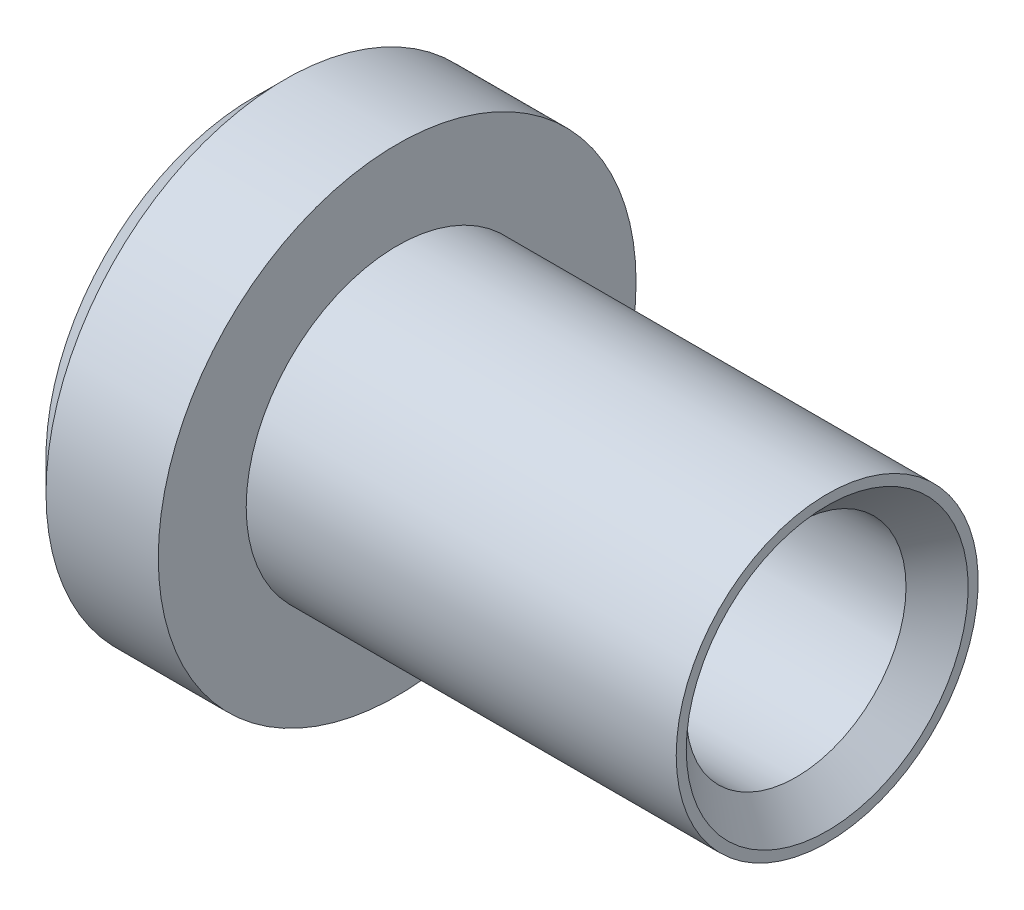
ISO-10303-21;
HEADER;
FILE_DESCRIPTION(('STEP AP214'),'2;1');
FILE_NAME('part.step','',(''),(''),'','','');
FILE_SCHEMA(('AUTOMOTIVE_DESIGN { 1 0 10303 214 1 1 1 1 }'));
ENDSEC;
DATA;
#1=APPLICATION_CONTEXT('core data for automotive mechanical design processes');
#2=APPLICATION_PROTOCOL_DEFINITION('international standard','automotive_design',2000,#1);
#3=PRODUCT_CONTEXT('',#1,'mechanical');
#4=PRODUCT('Part','Part','',(#3));
#5=PRODUCT_RELATED_PRODUCT_CATEGORY('part','',(#4));
#6=PRODUCT_DEFINITION_FORMATION('','',#4);
#7=PRODUCT_DEFINITION_CONTEXT('part definition',#1,'design');
#8=PRODUCT_DEFINITION('design','',#6,#7);
#9=PRODUCT_DEFINITION_SHAPE('','',#8);
#10=(LENGTH_UNIT() NAMED_UNIT(*) SI_UNIT(.MILLI.,.METRE.));
#11=(NAMED_UNIT(*) PLANE_ANGLE_UNIT() SI_UNIT($,.RADIAN.));
#12=(NAMED_UNIT(*) SI_UNIT($,.STERADIAN.) SOLID_ANGLE_UNIT());
#13=UNCERTAINTY_MEASURE_WITH_UNIT(LENGTH_MEASURE(1.E-05),#10,'distance_accuracy_value','');
#14=(GEOMETRIC_REPRESENTATION_CONTEXT(3) GLOBAL_UNCERTAINTY_ASSIGNED_CONTEXT((#13)) GLOBAL_UNIT_ASSIGNED_CONTEXT((#10,
#11,#12)) REPRESENTATION_CONTEXT('',''));
#15=CARTESIAN_POINT('',(0.,0.,0.));
#16=DIRECTION('',(0.,0.,1.));
#17=DIRECTION('',(1.,0.,0.));
#18=AXIS2_PLACEMENT_3D('',#15,#16,#17);
#19=CARTESIAN_POINT('',(0.,0.,0.));
#20=DIRECTION('',(1.,0.,0.));
#21=DIRECTION('',(0.,0.,-1.));
#22=AXIS2_PLACEMENT_3D('',#19,#20,#21);
#23=PLANE('',#22);
#24=CARTESIAN_POINT('',(0.,0.,0.));
#25=DIRECTION('',(1.,0.,0.));
#26=DIRECTION('',(0.,0.,-1.));
#27=AXIS2_PLACEMENT_3D('',#24,#25,#26);
#28=CIRCLE('',#27,5.5245);
#29=CARTESIAN_POINT('',(0.,0.,-5.5245));
#30=VERTEX_POINT('',#29);
#31=EDGE_CURVE('E44',#30,#30,#28,.F.);
#32=ORIENTED_EDGE('',*,*,#31,.T.);
#33=EDGE_LOOP('',(#32));
#34=FACE_BOUND('',#33,.T.);
#35=ADVANCED_FACE('F37',(#34),#23,.F.);
#36=CARTESIAN_POINT('',(0.,0.,0.));
#37=DIRECTION('',(-1.,0.,0.));
#38=DIRECTION('',(0.,0.,1.));
#39=AXIS2_PLACEMENT_3D('',#36,#37,#38);
#40=CYLINDRICAL_SURFACE('',#39,6.35);
#41=CARTESIAN_POINT('',(0.825500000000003,0.,0.));
#42=DIRECTION('',(1.,0.,0.));
#43=DIRECTION('',(0.,0.,-1.));
#44=AXIS2_PLACEMENT_3D('',#41,#42,#43);
#45=CIRCLE('',#44,6.35);
#46=CARTESIAN_POINT('',(0.825500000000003,0.,-6.35));
#47=VERTEX_POINT('',#46);
#48=EDGE_CURVE('E11',#47,#47,#45,.T.);
#49=ORIENTED_EDGE('',*,*,#48,.T.);
#50=EDGE_LOOP('',(#49));
#51=FACE_BOUND('',#50,.T.);
#52=CARTESIAN_POINT('',(3.81,0.,0.));
#53=DIRECTION('',(-1.,0.,0.));
#54=DIRECTION('',(0.,0.,1.));
#55=AXIS2_PLACEMENT_3D('',#52,#53,#54);
#56=CIRCLE('',#55,6.35);
#57=CARTESIAN_POINT('',(3.81,0.,6.35));
#58=VERTEX_POINT('',#57);
#59=EDGE_CURVE('E97',#58,#58,#56,.T.);
#60=ORIENTED_EDGE('',*,*,#59,.T.);
#61=EDGE_LOOP('',(#60));
#62=FACE_BOUND('',#61,.T.);
#63=ADVANCED_FACE('F63',(#51,#62),#40,.T.);
#64=CARTESIAN_POINT('',(3.81,6.35,0.));
#65=DIRECTION('',(-1.,0.,0.));
#66=DIRECTION('',(0.,0.,1.));
#67=AXIS2_PLACEMENT_3D('',#64,#65,#66);
#68=PLANE('',#67);
#69=ORIENTED_EDGE('',*,*,#59,.F.);
#70=EDGE_LOOP('',(#69));
#71=FACE_BOUND('',#70,.T.);
#72=CARTESIAN_POINT('',(3.81,0.,0.));
#73=DIRECTION('',(-1.,0.,0.));
#74=DIRECTION('',(0.,0.,1.));
#75=AXIS2_PLACEMENT_3D('',#72,#73,#74);
#76=CIRCLE('',#75,4.0132);
#77=CARTESIAN_POINT('',(3.81,0.,4.0132));
#78=VERTEX_POINT('',#77);
#79=EDGE_CURVE('E93',#78,#78,#76,.T.);
#80=ORIENTED_EDGE('',*,*,#79,.T.);
#81=EDGE_LOOP('',(#80));
#82=FACE_BOUND('',#81,.T.);
#83=ADVANCED_FACE('F69',(#71,#82),#68,.F.);
#84=CARTESIAN_POINT('',(0.,0.,0.));
#85=DIRECTION('',(-1.,0.,0.));
#86=DIRECTION('',(0.,0.,1.));
#87=AXIS2_PLACEMENT_3D('',#84,#85,#86);
#88=CYLINDRICAL_SURFACE('',#87,4.0132);
#89=ORIENTED_EDGE('',*,*,#79,.F.);
#90=EDGE_LOOP('',(#89));
#91=FACE_BOUND('',#90,.T.);
#92=CARTESIAN_POINT('',(15.24,0.,0.));
#93=DIRECTION('',(-1.,0.,0.));
#94=DIRECTION('',(0.,0.,1.));
#95=AXIS2_PLACEMENT_3D('',#92,#93,#94);
#96=CIRCLE('',#95,4.0132);
#97=CARTESIAN_POINT('',(15.24,0.,4.0132));
#98=VERTEX_POINT('',#97);
#99=EDGE_CURVE('E91',#98,#98,#96,.T.);
#100=ORIENTED_EDGE('',*,*,#99,.T.);
#101=EDGE_LOOP('',(#100));
#102=FACE_BOUND('',#101,.T.);
#103=ADVANCED_FACE('F76',(#91,#102),#88,.T.);
#104=CARTESIAN_POINT('',(15.24,4.0132,0.));
#105=DIRECTION('',(-1.,0.,0.));
#106=DIRECTION('',(0.,0.,1.));
#107=AXIS2_PLACEMENT_3D('',#104,#105,#106);
#108=PLANE('',#107);
#109=CARTESIAN_POINT('',(15.24,0.,0.));
#110=DIRECTION('',(-1.,0.,0.));
#111=DIRECTION('',(0.,0.,1.));
#112=AXIS2_PLACEMENT_3D('',#109,#110,#111);
#113=CIRCLE('',#112,3.74649999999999);
#114=CARTESIAN_POINT('',(15.24,0.,3.74649999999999));
#115=VERTEX_POINT('',#114);
#116=EDGE_CURVE('E88',#115,#115,#113,.T.);
#117=ORIENTED_EDGE('',*,*,#116,.T.);
#118=EDGE_LOOP('',(#117));
#119=FACE_BOUND('',#118,.T.);
#120=ORIENTED_EDGE('',*,*,#99,.F.);
#121=EDGE_LOOP('',(#120));
#122=FACE_BOUND('',#121,.T.);
#123=ADVANCED_FACE('F58',(#119,#122),#108,.F.);
#124=CARTESIAN_POINT('',(0.,0.,0.));
#125=DIRECTION('',(-1.,0.,0.));
#126=DIRECTION('',(0.,0.,1.));
#127=AXIS2_PLACEMENT_3D('',#124,#125,#126);
#128=CYLINDRICAL_SURFACE('',#127,2.921);
#129=CARTESIAN_POINT('',(14.4145,0.,0.));
#130=DIRECTION('',(-1.,0.,0.));
#131=DIRECTION('',(0.,0.,1.));
#132=AXIS2_PLACEMENT_3D('',#129,#130,#131);
#133=CIRCLE('',#132,2.921);
#134=CARTESIAN_POINT('',(14.4145,0.,2.921));
#135=VERTEX_POINT('',#134);
#136=EDGE_CURVE('E105',#135,#135,#133,.F.);
#137=ORIENTED_EDGE('',*,*,#136,.T.);
#138=EDGE_LOOP('',(#137));
#139=FACE_BOUND('',#138,.T.);
#140=CARTESIAN_POINT('',(4.445,0.,0.));
#141=DIRECTION('',(-1.,0.,0.));
#142=DIRECTION('',(0.,0.,1.));
#143=AXIS2_PLACEMENT_3D('',#140,#141,#142);
#144=CIRCLE('',#143,2.921);
#145=CARTESIAN_POINT('',(4.445,0.,2.921));
#146=VERTEX_POINT('',#145);
#147=EDGE_CURVE('E94',#146,#146,#144,.T.);
#148=ORIENTED_EDGE('',*,*,#147,.T.);
#149=EDGE_LOOP('',(#148));
#150=FACE_BOUND('',#149,.T.);
#151=ADVANCED_FACE('F50',(#139,#150),#128,.F.);
#152=CARTESIAN_POINT('',(2.68988613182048,0.,0.));
#153=DIRECTION('',(1.,0.,0.));
#154=DIRECTION('',(0.,0.,-1.));
#155=AXIS2_PLACEMENT_3D('',#152,#153,#154);
#156=CONICAL_SURFACE('',#155,0.,1.02974425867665);
#157=ORIENTED_EDGE('',*,*,#147,.F.);
#158=EDGE_LOOP('',(#157));
#159=FACE_BOUND('',#158,.T.);
#160=CARTESIAN_POINT('',(2.68988613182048,0.,0.));
#161=VERTEX_POINT('',#160);
#162=VERTEX_LOOP('',#161);
#163=FACE_BOUND('',#162,.T.);
#164=ADVANCED_FACE('F47',(#159,#163),#156,.F.);
#165=CARTESIAN_POINT('',(15.24,0.,0.));
#166=DIRECTION('',(1.,0.,0.));
#167=DIRECTION('',(0.,0.,-1.));
#168=AXIS2_PLACEMENT_3D('',#165,#166,#167);
#169=CONICAL_SURFACE('',#168,3.74649999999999,0.785398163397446);
#170=ORIENTED_EDGE('',*,*,#136,.F.);
#171=EDGE_LOOP('',(#170));
#172=FACE_BOUND('',#171,.T.);
#173=ORIENTED_EDGE('',*,*,#116,.F.);
#174=EDGE_LOOP('',(#173));
#175=FACE_BOUND('',#174,.T.);
#176=ADVANCED_FACE('F49',(#172,#175),#169,.F.);
#177=CARTESIAN_POINT('',(0.,0.,0.));
#178=DIRECTION('',(1.,0.,0.));
#179=DIRECTION('',(0.,0.,-1.));
#180=AXIS2_PLACEMENT_3D('',#177,#178,#179);
#181=CONICAL_SURFACE('',#180,5.5245,0.785398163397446);
#182=CARTESIAN_POINT('',(0.825500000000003,0.,-6.35));
#183=CARTESIAN_POINT('',(0.816901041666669,0.,-6.34140104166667));
#184=CARTESIAN_POINT('',(0.808302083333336,0.,-6.33280208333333));
#185=CARTESIAN_POINT('',(0.791104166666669,0.,-6.31560416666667));
#186=CARTESIAN_POINT('',(0.782505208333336,0.,-6.30700520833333));
#187=CARTESIAN_POINT('',(0.765307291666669,0.,-6.28980729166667));
#188=CARTESIAN_POINT('',(0.756708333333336,0.,-6.28120833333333));
#189=CARTESIAN_POINT('',(0.739510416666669,0.,-6.26401041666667));
#190=CARTESIAN_POINT('',(0.730911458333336,0.,-6.25541145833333));
#191=CARTESIAN_POINT('',(0.713713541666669,0.,-6.23821354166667));
#192=CARTESIAN_POINT('',(0.705114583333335,0.,-6.22961458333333));
#193=CARTESIAN_POINT('',(0.687916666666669,0.,-6.21241666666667));
#194=CARTESIAN_POINT('',(0.679317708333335,0.,-6.20381770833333));
#195=CARTESIAN_POINT('',(0.662119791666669,0.,-6.18661979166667));
#196=CARTESIAN_POINT('',(0.653520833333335,0.,-6.17802083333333));
#197=CARTESIAN_POINT('',(0.636322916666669,0.,-6.16082291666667));
#198=CARTESIAN_POINT('',(0.627723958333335,0.,-6.15222395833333));
#199=CARTESIAN_POINT('',(0.610526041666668,0.,-6.13502604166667));
#200=CARTESIAN_POINT('',(0.601927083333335,0.,-6.12642708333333));
#201=CARTESIAN_POINT('',(0.584729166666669,0.,-6.10922916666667));
#202=CARTESIAN_POINT('',(0.576130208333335,0.,-6.10063020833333));
#203=CARTESIAN_POINT('',(0.558932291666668,0.,-6.08343229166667));
#204=CARTESIAN_POINT('',(0.550333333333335,0.,-6.07483333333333));
#205=CARTESIAN_POINT('',(0.533135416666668,0.,-6.05763541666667));
#206=CARTESIAN_POINT('',(0.524536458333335,0.,-6.04903645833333));
#207=CARTESIAN_POINT('',(0.507338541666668,0.,-6.03183854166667));
#208=CARTESIAN_POINT('',(0.498739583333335,0.,-6.02323958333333));
#209=CARTESIAN_POINT('',(0.481541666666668,0.,-6.00604166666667));
#210=CARTESIAN_POINT('',(0.472942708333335,0.,-5.99744270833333));
#211=CARTESIAN_POINT('',(0.455744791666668,0.,-5.98024479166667));
#212=CARTESIAN_POINT('',(0.447145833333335,0.,-5.97164583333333));
#213=CARTESIAN_POINT('',(0.429947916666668,0.,-5.95444791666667));
#214=CARTESIAN_POINT('',(0.421348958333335,0.,-5.94584895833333));
#215=CARTESIAN_POINT('',(0.404151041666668,0.,-5.92865104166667));
#216=CARTESIAN_POINT('',(0.395552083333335,0.,-5.92005208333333));
#217=CARTESIAN_POINT('',(0.378354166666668,0.,-5.90285416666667));
#218=CARTESIAN_POINT('',(0.369755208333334,0.,-5.89425520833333));
#219=CARTESIAN_POINT('',(0.352557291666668,0.,-5.87705729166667));
#220=CARTESIAN_POINT('',(0.343958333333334,0.,-5.86845833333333));
#221=CARTESIAN_POINT('',(0.326760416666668,0.,-5.85126041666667));
#222=CARTESIAN_POINT('',(0.318161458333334,0.,-5.84266145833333));
#223=CARTESIAN_POINT('',(0.300963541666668,0.,-5.82546354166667));
#224=CARTESIAN_POINT('',(0.292364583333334,0.,-5.81686458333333));
#225=CARTESIAN_POINT('',(0.275166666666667,0.,-5.79966666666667));
#226=CARTESIAN_POINT('',(0.266567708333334,0.,-5.79106770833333));
#227=CARTESIAN_POINT('',(0.249369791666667,0.,-5.77386979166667));
#228=CARTESIAN_POINT('',(0.240770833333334,0.,-5.76527083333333));
#229=CARTESIAN_POINT('',(0.223572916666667,0.,-5.74807291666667));
#230=CARTESIAN_POINT('',(0.214973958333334,0.,-5.73947395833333));
#231=CARTESIAN_POINT('',(0.197776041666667,0.,-5.72227604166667));
#232=CARTESIAN_POINT('',(0.189177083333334,0.,-5.71367708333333));
#233=CARTESIAN_POINT('',(0.171979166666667,0.,-5.69647916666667));
#234=CARTESIAN_POINT('',(0.163380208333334,0.,-5.68788020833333));
#235=CARTESIAN_POINT('',(0.146182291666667,0.,-5.67068229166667));
#236=CARTESIAN_POINT('',(0.137583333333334,0.,-5.66208333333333));
#237=CARTESIAN_POINT('',(0.120385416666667,0.,-5.64488541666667));
#238=CARTESIAN_POINT('',(0.111786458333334,0.,-5.63628645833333));
#239=CARTESIAN_POINT('',(0.0945885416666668,0.,-5.61908854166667));
#240=CARTESIAN_POINT('',(0.0859895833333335,0.,-5.61048958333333));
#241=CARTESIAN_POINT('',(0.0687916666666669,0.,-5.59329166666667));
#242=CARTESIAN_POINT('',(0.0601927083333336,0.,-5.58469270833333));
#243=CARTESIAN_POINT('',(0.0429947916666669,0.,-5.56749479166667));
#244=CARTESIAN_POINT('',(0.0343958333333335,0.,-5.55889583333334));
#245=CARTESIAN_POINT('',(0.0171979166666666,0.,-5.54169791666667));
#246=CARTESIAN_POINT('',(0.00859895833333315,0.,-5.53309895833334));
#247=CARTESIAN_POINT('',(0.,0.,-5.5245));
#248=B_SPLINE_CURVE_WITH_KNOTS('',3,(#182,#183,#184,#185,#186,#187,#188,#189,#190,#191,#192,
#193,#194,#195,#196,#197,#198,#199,#200,#201,#202,#203,#204,#205,#206,#207,#208,#209,#210,#211,
#212,#213,#214,#215,#216,#217,#218,#219,#220,#221,#222,#223,#224,#225,#226,#227,#228,#229,#230,
#231,#232,#233,#234,#235,#236,#237,#238,#239,#240,#241,#242,#243,#244,#245,#246,#247),
.UNSPECIFIED.,.F.,.F.,(4,2,2,2,2,2,2,2,2,2,2,2,2,2,2,2,2,2,2,2,2,2,2,2,2,2,2,2,2,2,2,2,4),(0.,
0.0364822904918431,0.0729645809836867,0.10944687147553,0.145929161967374,0.182411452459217,
0.218893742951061,0.255376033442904,0.291858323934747,0.328340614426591,0.364822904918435,
0.401305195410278,0.437787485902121,0.474269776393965,0.510752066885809,0.547234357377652,
0.583716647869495,0.620198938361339,0.656681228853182,0.693163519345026,0.729645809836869,
0.766128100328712,0.802610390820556,0.8390926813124,0.875574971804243,0.912057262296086,
0.94853955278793,0.985021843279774,1.02150413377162,1.05798642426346,1.0944687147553,
1.13095100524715,1.16743329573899),.UNSPECIFIED.);
#249=EDGE_CURVE('BSEAM39',#47,#30,#248,.T.);
#250=ORIENTED_EDGE('',*,*,#48,.F.);
#251=ORIENTED_EDGE('',*,*,#31,.F.);
#252=ORIENTED_EDGE('',*,*,#249,.T.);
#253=ORIENTED_EDGE('',*,*,#249,.F.);
#254=EDGE_LOOP('',(#250,#252,#251,#253));
#255=FACE_BOUND('',#254,.T.);
#256=ADVANCED_FACE('F39',(#255),#181,.T.);
#257=CLOSED_SHELL('',(#35,#63,#83,#103,#123,#151,#164,#176,#256));
#258=MANIFOLD_SOLID_BREP('B2',#257);
#259=ADVANCED_BREP_SHAPE_REPRESENTATION('',(#18,#258),#14);
#260=SHAPE_DEFINITION_REPRESENTATION(#9,#259);
ENDSEC;
END-ISO-10303-21;
